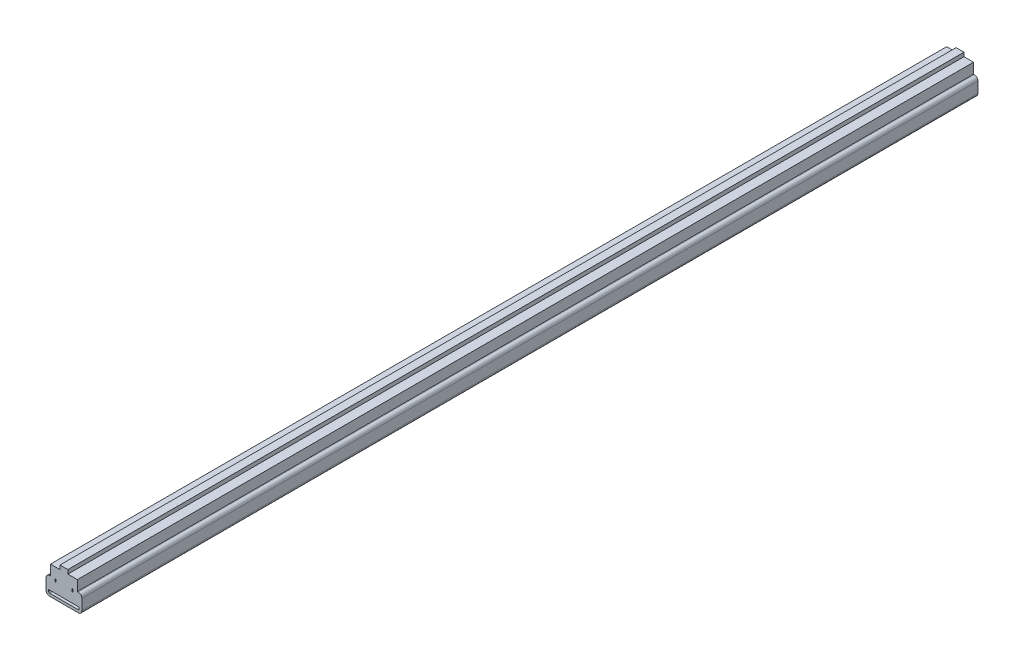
ISO-10303-21;
HEADER;
FILE_DESCRIPTION(('STEP AP214'),'2;1');
FILE_NAME('part.step','',(''),(''),'','','');
FILE_SCHEMA(('AUTOMOTIVE_DESIGN { 1 0 10303 214 1 1 1 1 }'));
ENDSEC;
DATA;
#1=APPLICATION_CONTEXT('core data for automotive mechanical design processes');
#2=APPLICATION_PROTOCOL_DEFINITION('international standard','automotive_design',2000,#1);
#3=PRODUCT_CONTEXT('',#1,'mechanical');
#4=PRODUCT('Part','Part','',(#3));
#5=PRODUCT_RELATED_PRODUCT_CATEGORY('part','',(#4));
#6=PRODUCT_DEFINITION_FORMATION('','',#4);
#7=PRODUCT_DEFINITION_CONTEXT('part definition',#1,'design');
#8=PRODUCT_DEFINITION('design','',#6,#7);
#9=PRODUCT_DEFINITION_SHAPE('','',#8);
#10=(LENGTH_UNIT() NAMED_UNIT(*) SI_UNIT(.MILLI.,.METRE.));
#11=(NAMED_UNIT(*) PLANE_ANGLE_UNIT() SI_UNIT($,.RADIAN.));
#12=(NAMED_UNIT(*) SI_UNIT($,.STERADIAN.) SOLID_ANGLE_UNIT());
#13=UNCERTAINTY_MEASURE_WITH_UNIT(LENGTH_MEASURE(1.E-05),#10,'distance_accuracy_value','');
#14=(GEOMETRIC_REPRESENTATION_CONTEXT(3) GLOBAL_UNCERTAINTY_ASSIGNED_CONTEXT((#13)) GLOBAL_UNIT_ASSIGNED_CONTEXT((#10,
#11,#12)) REPRESENTATION_CONTEXT('',''));
#15=CARTESIAN_POINT('',(0.,0.,0.));
#16=DIRECTION('',(0.,0.,1.));
#17=DIRECTION('',(1.,0.,0.));
#18=AXIS2_PLACEMENT_3D('',#15,#16,#17);
#19=CARTESIAN_POINT('',(-8.,8.,500.));
#20=DIRECTION('',(0.,0.,-1.));
#21=DIRECTION('',(-1.,0.,0.));
#22=AXIS2_PLACEMENT_3D('',#19,#20,#21);
#23=CYLINDRICAL_SURFACE('',#22,2.);
#24=CARTESIAN_POINT('',(-8.,8.,0.));
#25=DIRECTION('',(0.,0.,1.));
#26=DIRECTION('',(-1.,0.,0.));
#27=AXIS2_PLACEMENT_3D('',#24,#25,#26);
#28=CIRCLE('',#27,2.);
#29=CARTESIAN_POINT('',(-8.,10.,0.));
#30=VERTEX_POINT('',#29);
#31=CARTESIAN_POINT('',(-10.,8.,0.));
#32=VERTEX_POINT('',#31);
#33=EDGE_CURVE('E327',#30,#32,#28,.T.);
#34=ORIENTED_EDGE('',*,*,#33,.T.);
#35=DIRECTION('',(0.,0.,-1.));
#36=VECTOR('',#35,1.);
#37=CARTESIAN_POINT('',(-10.,8.,500.));
#38=LINE('',#37,#36);
#39=CARTESIAN_POINT('',(-10.,8.,500.));
#40=VERTEX_POINT('',#39);
#41=EDGE_CURVE('E9',#40,#32,#38,.T.);
#42=ORIENTED_EDGE('',*,*,#41,.F.);
#43=CARTESIAN_POINT('',(-8.,8.,500.));
#44=DIRECTION('',(0.,0.,1.));
#45=DIRECTION('',(-1.,0.,0.));
#46=AXIS2_PLACEMENT_3D('',#43,#44,#45);
#47=CIRCLE('',#46,2.);
#48=CARTESIAN_POINT('',(-8.,10.,500.));
#49=VERTEX_POINT('',#48);
#50=EDGE_CURVE('E328',#49,#40,#47,.T.);
#51=ORIENTED_EDGE('',*,*,#50,.F.);
#52=DIRECTION('',(0.,0.,-1.));
#53=VECTOR('',#52,1.);
#54=CARTESIAN_POINT('',(-8.,10.,500.));
#55=LINE('',#54,#53);
#56=EDGE_CURVE('E362',#49,#30,#55,.T.);
#57=ORIENTED_EDGE('',*,*,#56,.T.);
#58=EDGE_LOOP('',(#34,#42,#51,#57));
#59=FACE_BOUND('',#58,.T.);
#60=ADVANCED_FACE('F14',(#59),#23,.T.);
#61=CARTESIAN_POINT('',(-10.,8.,500.));
#62=DIRECTION('',(1.,0.,0.));
#63=DIRECTION('',(0.,0.,-1.));
#64=AXIS2_PLACEMENT_3D('',#61,#62,#63);
#65=PLANE('',#64);
#66=DIRECTION('',(0.,-1.,0.));
#67=VECTOR('',#66,1.);
#68=CARTESIAN_POINT('',(-10.,8.,0.));
#69=LINE('',#68,#67);
#70=CARTESIAN_POINT('',(-10.,2.,0.));
#71=VERTEX_POINT('',#70);
#72=EDGE_CURVE('E365',#32,#71,#69,.T.);
#73=ORIENTED_EDGE('',*,*,#72,.T.);
#74=DIRECTION('',(0.,0.,-1.));
#75=VECTOR('',#74,1.);
#76=CARTESIAN_POINT('',(-10.,2.,500.));
#77=LINE('',#76,#75);
#78=CARTESIAN_POINT('',(-10.,2.,500.));
#79=VERTEX_POINT('',#78);
#80=EDGE_CURVE('E21',#79,#71,#77,.T.);
#81=ORIENTED_EDGE('',*,*,#80,.F.);
#82=DIRECTION('',(0.,-1.,0.));
#83=VECTOR('',#82,1.);
#84=CARTESIAN_POINT('',(-10.,8.,500.));
#85=LINE('',#84,#83);
#86=EDGE_CURVE('E331',#40,#79,#85,.T.);
#87=ORIENTED_EDGE('',*,*,#86,.F.);
#88=ORIENTED_EDGE('',*,*,#41,.T.);
#89=EDGE_LOOP('',(#73,#81,#87,#88));
#90=FACE_BOUND('',#89,.T.);
#91=ADVANCED_FACE('F461',(#90),#65,.F.);
#92=CARTESIAN_POINT('',(-8.,2.,500.));
#93=DIRECTION('',(0.,0.,-1.));
#94=DIRECTION('',(-1.,0.,0.));
#95=AXIS2_PLACEMENT_3D('',#92,#93,#94);
#96=CYLINDRICAL_SURFACE('',#95,2.);
#97=CARTESIAN_POINT('',(-8.,2.,0.));
#98=DIRECTION('',(0.,0.,1.));
#99=DIRECTION('',(-1.,0.,0.));
#100=AXIS2_PLACEMENT_3D('',#97,#98,#99);
#101=CIRCLE('',#100,2.);
#102=CARTESIAN_POINT('',(-8.,0.,0.));
#103=VERTEX_POINT('',#102);
#104=EDGE_CURVE('E367',#71,#103,#101,.T.);
#105=ORIENTED_EDGE('',*,*,#104,.T.);
#106=DIRECTION('',(0.,0.,-1.));
#107=VECTOR('',#106,1.);
#108=CARTESIAN_POINT('',(-8.,0.,500.));
#109=LINE('',#108,#107);
#110=CARTESIAN_POINT('',(-8.,0.,500.));
#111=VERTEX_POINT('',#110);
#112=EDGE_CURVE('E432',#111,#103,#109,.T.);
#113=ORIENTED_EDGE('',*,*,#112,.F.);
#114=CARTESIAN_POINT('',(-8.,2.,500.));
#115=DIRECTION('',(0.,0.,1.));
#116=DIRECTION('',(-1.,0.,0.));
#117=AXIS2_PLACEMENT_3D('',#114,#115,#116);
#118=CIRCLE('',#117,2.);
#119=EDGE_CURVE('E334',#79,#111,#118,.T.);
#120=ORIENTED_EDGE('',*,*,#119,.F.);
#121=ORIENTED_EDGE('',*,*,#80,.T.);
#122=EDGE_LOOP('',(#105,#113,#120,#121));
#123=FACE_BOUND('',#122,.T.);
#124=ADVANCED_FACE('F439',(#123),#96,.T.);
#125=CARTESIAN_POINT('',(-8.,0.,500.));
#126=DIRECTION('',(0.,1.,0.));
#127=DIRECTION('',(0.,0.,1.));
#128=AXIS2_PLACEMENT_3D('',#125,#126,#127);
#129=PLANE('',#128);
#130=DIRECTION('',(1.,0.,0.));
#131=VECTOR('',#130,1.);
#132=CARTESIAN_POINT('',(-8.,0.,0.));
#133=LINE('',#132,#131);
#134=CARTESIAN_POINT('',(8.,0.,0.));
#135=VERTEX_POINT('',#134);
#136=EDGE_CURVE('E369',#103,#135,#133,.T.);
#137=ORIENTED_EDGE('',*,*,#136,.T.);
#138=DIRECTION('',(0.,0.,-1.));
#139=VECTOR('',#138,1.);
#140=CARTESIAN_POINT('',(8.,0.,500.));
#141=LINE('',#140,#139);
#142=CARTESIAN_POINT('',(8.,0.,500.));
#143=VERTEX_POINT('',#142);
#144=EDGE_CURVE('E429',#143,#135,#141,.T.);
#145=ORIENTED_EDGE('',*,*,#144,.F.);
#146=DIRECTION('',(1.,0.,0.));
#147=VECTOR('',#146,1.);
#148=CARTESIAN_POINT('',(-8.,0.,500.));
#149=LINE('',#148,#147);
#150=EDGE_CURVE('E336',#111,#143,#149,.T.);
#151=ORIENTED_EDGE('',*,*,#150,.F.);
#152=ORIENTED_EDGE('',*,*,#112,.T.);
#153=EDGE_LOOP('',(#137,#145,#151,#152));
#154=FACE_BOUND('',#153,.T.);
#155=ADVANCED_FACE('F449',(#154),#129,.F.);
#156=CARTESIAN_POINT('',(8.,2.,500.));
#157=DIRECTION('',(0.,0.,-1.));
#158=DIRECTION('',(-1.,0.,0.));
#159=AXIS2_PLACEMENT_3D('',#156,#157,#158);
#160=CYLINDRICAL_SURFACE('',#159,2.);
#161=CARTESIAN_POINT('',(8.,2.,0.));
#162=DIRECTION('',(0.,0.,1.));
#163=DIRECTION('',(-1.,0.,0.));
#164=AXIS2_PLACEMENT_3D('',#161,#162,#163);
#165=CIRCLE('',#164,2.);
#166=CARTESIAN_POINT('',(10.,2.,0.));
#167=VERTEX_POINT('',#166);
#168=EDGE_CURVE('E371',#135,#167,#165,.T.);
#169=ORIENTED_EDGE('',*,*,#168,.T.);
#170=DIRECTION('',(0.,0.,-1.));
#171=VECTOR('',#170,1.);
#172=CARTESIAN_POINT('',(10.,2.,500.));
#173=LINE('',#172,#171);
#174=CARTESIAN_POINT('',(10.,2.,500.));
#175=VERTEX_POINT('',#174);
#176=EDGE_CURVE('E426',#175,#167,#173,.T.);
#177=ORIENTED_EDGE('',*,*,#176,.F.);
#178=CARTESIAN_POINT('',(8.,2.,500.));
#179=DIRECTION('',(0.,0.,1.));
#180=DIRECTION('',(-1.,0.,0.));
#181=AXIS2_PLACEMENT_3D('',#178,#179,#180);
#182=CIRCLE('',#181,2.);
#183=EDGE_CURVE('E338',#143,#175,#182,.T.);
#184=ORIENTED_EDGE('',*,*,#183,.F.);
#185=ORIENTED_EDGE('',*,*,#144,.T.);
#186=EDGE_LOOP('',(#169,#177,#184,#185));
#187=FACE_BOUND('',#186,.T.);
#188=ADVANCED_FACE('F453',(#187),#160,.T.);
#189=CARTESIAN_POINT('',(10.,8.,500.));
#190=DIRECTION('',(-1.,0.,0.));
#191=DIRECTION('',(0.,0.,1.));
#192=AXIS2_PLACEMENT_3D('',#189,#190,#191);
#193=PLANE('',#192);
#194=DIRECTION('',(0.,1.,0.));
#195=VECTOR('',#194,1.);
#196=CARTESIAN_POINT('',(10.,8.,0.));
#197=LINE('',#196,#195);
#198=CARTESIAN_POINT('',(10.,8.,0.));
#199=VERTEX_POINT('',#198);
#200=EDGE_CURVE('E373',#167,#199,#197,.T.);
#201=ORIENTED_EDGE('',*,*,#200,.T.);
#202=DIRECTION('',(0.,0.,-1.));
#203=VECTOR('',#202,1.);
#204=CARTESIAN_POINT('',(10.,8.,500.));
#205=LINE('',#204,#203);
#206=CARTESIAN_POINT('',(10.,8.,500.));
#207=VERTEX_POINT('',#206);
#208=EDGE_CURVE('E423',#207,#199,#205,.T.);
#209=ORIENTED_EDGE('',*,*,#208,.F.);
#210=DIRECTION('',(0.,1.,0.));
#211=VECTOR('',#210,1.);
#212=CARTESIAN_POINT('',(10.,8.,500.));
#213=LINE('',#212,#211);
#214=EDGE_CURVE('E340',#175,#207,#213,.T.);
#215=ORIENTED_EDGE('',*,*,#214,.F.);
#216=ORIENTED_EDGE('',*,*,#176,.T.);
#217=EDGE_LOOP('',(#201,#209,#215,#216));
#218=FACE_BOUND('',#217,.T.);
#219=ADVANCED_FACE('F514',(#218),#193,.F.);
#220=CARTESIAN_POINT('',(8.,8.,500.));
#221=DIRECTION('',(0.,0.,-1.));
#222=DIRECTION('',(-1.,0.,0.));
#223=AXIS2_PLACEMENT_3D('',#220,#221,#222);
#224=CYLINDRICAL_SURFACE('',#223,2.);
#225=CARTESIAN_POINT('',(8.,8.,0.));
#226=DIRECTION('',(0.,0.,1.));
#227=DIRECTION('',(-1.,0.,0.));
#228=AXIS2_PLACEMENT_3D('',#225,#226,#227);
#229=CIRCLE('',#228,2.);
#230=CARTESIAN_POINT('',(8.,10.,0.));
#231=VERTEX_POINT('',#230);
#232=EDGE_CURVE('E375',#199,#231,#229,.T.);
#233=ORIENTED_EDGE('',*,*,#232,.T.);
#234=DIRECTION('',(0.,0.,-1.));
#235=VECTOR('',#234,1.);
#236=CARTESIAN_POINT('',(8.,10.,500.));
#237=LINE('',#236,#235);
#238=CARTESIAN_POINT('',(8.,10.,500.));
#239=VERTEX_POINT('',#238);
#240=EDGE_CURVE('E420',#239,#231,#237,.T.);
#241=ORIENTED_EDGE('',*,*,#240,.F.);
#242=CARTESIAN_POINT('',(8.,8.,500.));
#243=DIRECTION('',(0.,0.,1.));
#244=DIRECTION('',(-1.,0.,0.));
#245=AXIS2_PLACEMENT_3D('',#242,#243,#244);
#246=CIRCLE('',#245,2.);
#247=EDGE_CURVE('E342',#207,#239,#246,.T.);
#248=ORIENTED_EDGE('',*,*,#247,.F.);
#249=ORIENTED_EDGE('',*,*,#208,.T.);
#250=EDGE_LOOP('',(#233,#241,#248,#249));
#251=FACE_BOUND('',#250,.T.);
#252=ADVANCED_FACE('F511',(#251),#224,.T.);
#253=CARTESIAN_POINT('',(7.5,10.,500.));
#254=DIRECTION('',(0.,-1.,0.));
#255=DIRECTION('',(0.,0.,-1.));
#256=AXIS2_PLACEMENT_3D('',#253,#254,#255);
#257=PLANE('',#256);
#258=DIRECTION('',(-1.,0.,0.));
#259=VECTOR('',#258,1.);
#260=CARTESIAN_POINT('',(7.5,10.,0.));
#261=LINE('',#260,#259);
#262=CARTESIAN_POINT('',(7.5,10.,0.));
#263=VERTEX_POINT('',#262);
#264=EDGE_CURVE('E377',#231,#263,#261,.T.);
#265=ORIENTED_EDGE('',*,*,#264,.T.);
#266=DIRECTION('',(0.,0.,-1.));
#267=VECTOR('',#266,1.);
#268=CARTESIAN_POINT('',(7.5,10.,500.));
#269=LINE('',#268,#267);
#270=CARTESIAN_POINT('',(7.5,10.,500.));
#271=VERTEX_POINT('',#270);
#272=EDGE_CURVE('E417',#271,#263,#269,.T.);
#273=ORIENTED_EDGE('',*,*,#272,.F.);
#274=DIRECTION('',(-1.,0.,0.));
#275=VECTOR('',#274,1.);
#276=CARTESIAN_POINT('',(7.5,10.,500.));
#277=LINE('',#276,#275);
#278=EDGE_CURVE('E344',#239,#271,#277,.T.);
#279=ORIENTED_EDGE('',*,*,#278,.F.);
#280=ORIENTED_EDGE('',*,*,#240,.T.);
#281=EDGE_LOOP('',(#265,#273,#279,#280));
#282=FACE_BOUND('',#281,.T.);
#283=ADVANCED_FACE('F507',(#282),#257,.F.);
#284=CARTESIAN_POINT('',(7.5,15.8,500.));
#285=DIRECTION('',(-1.,0.,0.));
#286=DIRECTION('',(0.,0.,1.));
#287=AXIS2_PLACEMENT_3D('',#284,#285,#286);
#288=PLANE('',#287);
#289=DIRECTION('',(0.,1.,0.));
#290=VECTOR('',#289,1.);
#291=CARTESIAN_POINT('',(7.5,15.8,0.));
#292=LINE('',#291,#290);
#293=CARTESIAN_POINT('',(7.5,15.8,0.));
#294=VERTEX_POINT('',#293);
#295=EDGE_CURVE('E379',#263,#294,#292,.T.);
#296=ORIENTED_EDGE('',*,*,#295,.T.);
#297=DIRECTION('',(0.,0.,-1.));
#298=VECTOR('',#297,1.);
#299=CARTESIAN_POINT('',(7.5,15.8,500.));
#300=LINE('',#299,#298);
#301=CARTESIAN_POINT('',(7.5,15.8,500.));
#302=VERTEX_POINT('',#301);
#303=EDGE_CURVE('E414',#302,#294,#300,.T.);
#304=ORIENTED_EDGE('',*,*,#303,.F.);
#305=DIRECTION('',(0.,1.,0.));
#306=VECTOR('',#305,1.);
#307=CARTESIAN_POINT('',(7.5,15.8,500.));
#308=LINE('',#307,#306);
#309=EDGE_CURVE('E346',#271,#302,#308,.T.);
#310=ORIENTED_EDGE('',*,*,#309,.F.);
#311=ORIENTED_EDGE('',*,*,#272,.T.);
#312=EDGE_LOOP('',(#296,#304,#310,#311));
#313=FACE_BOUND('',#312,.T.);
#314=ADVANCED_FACE('F503',(#313),#288,.F.);
#315=CARTESIAN_POINT('',(2.2,15.8,500.));
#316=DIRECTION('',(0.,-1.,0.));
#317=DIRECTION('',(0.,0.,-1.));
#318=AXIS2_PLACEMENT_3D('',#315,#316,#317);
#319=PLANE('',#318);
#320=DIRECTION('',(-1.,0.,0.));
#321=VECTOR('',#320,1.);
#322=CARTESIAN_POINT('',(2.2,15.8,0.));
#323=LINE('',#322,#321);
#324=CARTESIAN_POINT('',(2.2,15.8,0.));
#325=VERTEX_POINT('',#324);
#326=EDGE_CURVE('E381',#294,#325,#323,.T.);
#327=ORIENTED_EDGE('',*,*,#326,.T.);
#328=DIRECTION('',(0.,0.,-1.));
#329=VECTOR('',#328,1.);
#330=CARTESIAN_POINT('',(2.2,15.8,500.));
#331=LINE('',#330,#329);
#332=CARTESIAN_POINT('',(2.2,15.8,500.));
#333=VERTEX_POINT('',#332);
#334=EDGE_CURVE('E411',#333,#325,#331,.T.);
#335=ORIENTED_EDGE('',*,*,#334,.F.);
#336=DIRECTION('',(-1.,0.,0.));
#337=VECTOR('',#336,1.);
#338=CARTESIAN_POINT('',(2.2,15.8,500.));
#339=LINE('',#338,#337);
#340=EDGE_CURVE('E348',#302,#333,#339,.T.);
#341=ORIENTED_EDGE('',*,*,#340,.F.);
#342=ORIENTED_EDGE('',*,*,#303,.T.);
#343=EDGE_LOOP('',(#327,#335,#341,#342));
#344=FACE_BOUND('',#343,.T.);
#345=ADVANCED_FACE('F498',(#344),#319,.F.);
#346=CARTESIAN_POINT('',(2.2,18.,500.));
#347=DIRECTION('',(-1.,0.,0.));
#348=DIRECTION('',(0.,-1.,0.));
#349=AXIS2_PLACEMENT_3D('',#346,#347,#348);
#350=PLANE('',#349);
#351=DIRECTION('',(0.,1.,0.));
#352=VECTOR('',#351,1.);
#353=CARTESIAN_POINT('',(2.2,18.,0.));
#354=LINE('',#353,#352);
#355=CARTESIAN_POINT('',(2.2,18.,0.));
#356=VERTEX_POINT('',#355);
#357=EDGE_CURVE('E383',#325,#356,#354,.T.);
#358=ORIENTED_EDGE('',*,*,#357,.T.);
#359=DIRECTION('',(0.,0.,-1.));
#360=VECTOR('',#359,1.);
#361=CARTESIAN_POINT('',(2.2,18.,500.));
#362=LINE('',#361,#360);
#363=CARTESIAN_POINT('',(2.2,18.,500.));
#364=VERTEX_POINT('',#363);
#365=EDGE_CURVE('E408',#364,#356,#362,.T.);
#366=ORIENTED_EDGE('',*,*,#365,.F.);
#367=DIRECTION('',(0.,1.,0.));
#368=VECTOR('',#367,1.);
#369=CARTESIAN_POINT('',(2.2,18.,500.));
#370=LINE('',#369,#368);
#371=EDGE_CURVE('E350',#333,#364,#370,.T.);
#372=ORIENTED_EDGE('',*,*,#371,.F.);
#373=ORIENTED_EDGE('',*,*,#334,.T.);
#374=EDGE_LOOP('',(#358,#366,#372,#373));
#375=FACE_BOUND('',#374,.T.);
#376=ADVANCED_FACE('F492',(#375),#350,.F.);
#377=CARTESIAN_POINT('',(-2.20000000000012,18.,500.));
#378=DIRECTION('',(0.,-1.,0.));
#379=DIRECTION('',(0.,0.,-1.));
#380=AXIS2_PLACEMENT_3D('',#377,#378,#379);
#381=PLANE('',#380);
#382=DIRECTION('',(-1.,0.,0.));
#383=VECTOR('',#382,1.);
#384=CARTESIAN_POINT('',(-2.20000000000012,18.,0.));
#385=LINE('',#384,#383);
#386=CARTESIAN_POINT('',(-2.20000000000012,18.,0.));
#387=VERTEX_POINT('',#386);
#388=EDGE_CURVE('E385',#356,#387,#385,.T.);
#389=ORIENTED_EDGE('',*,*,#388,.T.);
#390=DIRECTION('',(0.,0.,-1.));
#391=VECTOR('',#390,1.);
#392=CARTESIAN_POINT('',(-2.20000000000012,18.,500.));
#393=LINE('',#392,#391);
#394=CARTESIAN_POINT('',(-2.20000000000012,18.,500.));
#395=VERTEX_POINT('',#394);
#396=EDGE_CURVE('E405',#395,#387,#393,.T.);
#397=ORIENTED_EDGE('',*,*,#396,.F.);
#398=DIRECTION('',(-1.,0.,0.));
#399=VECTOR('',#398,1.);
#400=CARTESIAN_POINT('',(-2.20000000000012,18.,500.));
#401=LINE('',#400,#399);
#402=EDGE_CURVE('E352',#364,#395,#401,.T.);
#403=ORIENTED_EDGE('',*,*,#402,.F.);
#404=ORIENTED_EDGE('',*,*,#365,.T.);
#405=EDGE_LOOP('',(#389,#397,#403,#404));
#406=FACE_BOUND('',#405,.T.);
#407=ADVANCED_FACE('F488',(#406),#381,.F.);
#408=CARTESIAN_POINT('',(-2.20000000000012,18.,500.));
#409=DIRECTION('',(1.,0.,0.));
#410=DIRECTION('',(0.,1.,0.));
#411=AXIS2_PLACEMENT_3D('',#408,#409,#410);
#412=PLANE('',#411);
#413=DIRECTION('',(0.,-1.,0.));
#414=VECTOR('',#413,1.);
#415=CARTESIAN_POINT('',(-2.20000000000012,18.,0.));
#416=LINE('',#415,#414);
#417=CARTESIAN_POINT('',(-2.20000000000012,15.8,0.));
#418=VERTEX_POINT('',#417);
#419=EDGE_CURVE('E387',#387,#418,#416,.T.);
#420=ORIENTED_EDGE('',*,*,#419,.T.);
#421=DIRECTION('',(0.,0.,-1.));
#422=VECTOR('',#421,1.);
#423=CARTESIAN_POINT('',(-2.20000000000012,15.8,500.));
#424=LINE('',#423,#422);
#425=CARTESIAN_POINT('',(-2.20000000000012,15.8,500.));
#426=VERTEX_POINT('',#425);
#427=EDGE_CURVE('E402',#426,#418,#424,.T.);
#428=ORIENTED_EDGE('',*,*,#427,.F.);
#429=DIRECTION('',(0.,-1.,0.));
#430=VECTOR('',#429,1.);
#431=CARTESIAN_POINT('',(-2.20000000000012,18.,500.));
#432=LINE('',#431,#430);
#433=EDGE_CURVE('E354',#395,#426,#432,.T.);
#434=ORIENTED_EDGE('',*,*,#433,.F.);
#435=ORIENTED_EDGE('',*,*,#396,.T.);
#436=EDGE_LOOP('',(#420,#428,#434,#435));
#437=FACE_BOUND('',#436,.T.);
#438=ADVANCED_FACE('F483',(#437),#412,.F.);
#439=CARTESIAN_POINT('',(-2.20000000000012,15.8,500.));
#440=DIRECTION('',(0.,-1.,0.));
#441=DIRECTION('',(0.,0.,-1.));
#442=AXIS2_PLACEMENT_3D('',#439,#440,#441);
#443=PLANE('',#442);
#444=DIRECTION('',(-1.,0.,0.));
#445=VECTOR('',#444,1.);
#446=CARTESIAN_POINT('',(-2.20000000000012,15.8,0.));
#447=LINE('',#446,#445);
#448=CARTESIAN_POINT('',(-7.5,15.8,0.));
#449=VERTEX_POINT('',#448);
#450=EDGE_CURVE('E389',#418,#449,#447,.T.);
#451=ORIENTED_EDGE('',*,*,#450,.T.);
#452=DIRECTION('',(0.,0.,-1.));
#453=VECTOR('',#452,1.);
#454=CARTESIAN_POINT('',(-7.5,15.8,500.));
#455=LINE('',#454,#453);
#456=CARTESIAN_POINT('',(-7.5,15.8,500.));
#457=VERTEX_POINT('',#456);
#458=EDGE_CURVE('E399',#457,#449,#455,.T.);
#459=ORIENTED_EDGE('',*,*,#458,.F.);
#460=DIRECTION('',(-1.,0.,0.));
#461=VECTOR('',#460,1.);
#462=CARTESIAN_POINT('',(-2.20000000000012,15.8,500.));
#463=LINE('',#462,#461);
#464=EDGE_CURVE('E356',#426,#457,#463,.T.);
#465=ORIENTED_EDGE('',*,*,#464,.F.);
#466=ORIENTED_EDGE('',*,*,#427,.T.);
#467=EDGE_LOOP('',(#451,#459,#465,#466));
#468=FACE_BOUND('',#467,.T.);
#469=ADVANCED_FACE('F477',(#468),#443,.F.);
#470=CARTESIAN_POINT('',(-7.5,15.8,500.));
#471=DIRECTION('',(1.,0.,0.));
#472=DIRECTION('',(0.,1.,0.));
#473=AXIS2_PLACEMENT_3D('',#470,#471,#472);
#474=PLANE('',#473);
#475=DIRECTION('',(0.,-1.,0.));
#476=VECTOR('',#475,1.);
#477=CARTESIAN_POINT('',(-7.5,15.8,0.));
#478=LINE('',#477,#476);
#479=CARTESIAN_POINT('',(-7.5,10.,0.));
#480=VERTEX_POINT('',#479);
#481=EDGE_CURVE('E391',#449,#480,#478,.T.);
#482=ORIENTED_EDGE('',*,*,#481,.T.);
#483=DIRECTION('',(0.,0.,-1.));
#484=VECTOR('',#483,1.);
#485=CARTESIAN_POINT('',(-7.5,10.,500.));
#486=LINE('',#485,#484);
#487=CARTESIAN_POINT('',(-7.5,10.,500.));
#488=VERTEX_POINT('',#487);
#489=EDGE_CURVE('E396',#488,#480,#486,.T.);
#490=ORIENTED_EDGE('',*,*,#489,.F.);
#491=DIRECTION('',(0.,-1.,0.));
#492=VECTOR('',#491,1.);
#493=CARTESIAN_POINT('',(-7.5,15.8,500.));
#494=LINE('',#493,#492);
#495=EDGE_CURVE('E358',#457,#488,#494,.T.);
#496=ORIENTED_EDGE('',*,*,#495,.F.);
#497=ORIENTED_EDGE('',*,*,#458,.T.);
#498=EDGE_LOOP('',(#482,#490,#496,#497));
#499=FACE_BOUND('',#498,.T.);
#500=ADVANCED_FACE('F473',(#499),#474,.F.);
#501=CARTESIAN_POINT('',(-8.,10.,500.));
#502=DIRECTION('',(0.,-1.,0.));
#503=DIRECTION('',(0.,0.,-1.));
#504=AXIS2_PLACEMENT_3D('',#501,#502,#503);
#505=PLANE('',#504);
#506=DIRECTION('',(-1.,0.,0.));
#507=VECTOR('',#506,1.);
#508=CARTESIAN_POINT('',(-8.,10.,0.));
#509=LINE('',#508,#507);
#510=EDGE_CURVE('E332',#480,#30,#509,.T.);
#511=ORIENTED_EDGE('',*,*,#510,.T.);
#512=ORIENTED_EDGE('',*,*,#56,.F.);
#513=DIRECTION('',(-1.,0.,0.));
#514=VECTOR('',#513,1.);
#515=CARTESIAN_POINT('',(-8.,10.,500.));
#516=LINE('',#515,#514);
#517=EDGE_CURVE('E360',#488,#49,#516,.T.);
#518=ORIENTED_EDGE('',*,*,#517,.F.);
#519=ORIENTED_EDGE('',*,*,#489,.T.);
#520=EDGE_LOOP('',(#511,#512,#518,#519));
#521=FACE_BOUND('',#520,.T.);
#522=ADVANCED_FACE('F468',(#521),#505,.F.);
#523=CARTESIAN_POINT('',(-8.,8.,500.));
#524=DIRECTION('',(0.,0.,-1.));
#525=DIRECTION('',(-1.,0.,0.));
#526=AXIS2_PLACEMENT_3D('',#523,#524,#525);
#527=PLANE('',#526);
#528=DIRECTION('',(-1.,1.80411241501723E-13,0.));
#529=VECTOR('',#528,1.);
#530=CARTESIAN_POINT('',(4.45478069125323,9.99948873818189,500.));
#531=LINE('',#530,#529);
#532=CARTESIAN_POINT('',(4.95478069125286,9.9994887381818,500.));
#533=VERTEX_POINT('',#532);
#534=CARTESIAN_POINT('',(4.45478069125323,9.99948873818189,500.));
#535=VERTEX_POINT('',#534);
#536=EDGE_CURVE('E234',#533,#535,#531,.T.);
#537=ORIENTED_EDGE('',*,*,#536,.F.);
#538=DIRECTION('',(0.,1.,0.));
#539=VECTOR('',#538,1.);
#540=CARTESIAN_POINT('',(4.95478069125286,8.49948873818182,500.));
#541=LINE('',#540,#539);
#542=CARTESIAN_POINT('',(4.95478069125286,8.49948873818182,500.));
#543=VERTEX_POINT('',#542);
#544=EDGE_CURVE('E227',#543,#533,#541,.T.);
#545=ORIENTED_EDGE('',*,*,#544,.F.);
#546=DIRECTION('',(1.,-1.52655665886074E-13,0.));
#547=VECTOR('',#546,1.);
#548=CARTESIAN_POINT('',(4.45478069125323,8.49948873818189,500.));
#549=LINE('',#548,#547);
#550=CARTESIAN_POINT('',(4.45478069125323,8.49948873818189,500.));
#551=VERTEX_POINT('',#550);
#552=EDGE_CURVE('E238',#551,#543,#549,.T.);
#553=ORIENTED_EDGE('',*,*,#552,.F.);
#554=DIRECTION('',(0.,-1.,0.));
#555=VECTOR('',#554,1.);
#556=CARTESIAN_POINT('',(4.45478069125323,8.49948873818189,500.));
#557=LINE('',#556,#555);
#558=EDGE_CURVE('E28',#535,#551,#557,.T.);
#559=ORIENTED_EDGE('',*,*,#558,.F.);
#560=EDGE_LOOP('',(#537,#545,#553,#559));
#561=FACE_BOUND('',#560,.T.);
#562=DIRECTION('',(-1.,-1.45716771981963E-13,0.));
#563=VECTOR('',#562,1.);
#564=CARTESIAN_POINT('',(-5.04521930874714,9.99948873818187,500.));
#565=LINE('',#564,#563);
#566=CARTESIAN_POINT('',(-4.54521930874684,9.99948873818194,500.));
#567=VERTEX_POINT('',#566);
#568=CARTESIAN_POINT('',(-5.04521930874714,9.99948873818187,500.));
#569=VERTEX_POINT('',#568);
#570=EDGE_CURVE('E251',#567,#569,#565,.T.);
#571=ORIENTED_EDGE('',*,*,#570,.F.);
#572=DIRECTION('',(0.,1.,0.));
#573=VECTOR('',#572,1.);
#574=CARTESIAN_POINT('',(-4.54521930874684,8.49948873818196,500.));
#575=LINE('',#574,#573);
#576=CARTESIAN_POINT('',(-4.54521930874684,8.49948873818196,500.));
#577=VERTEX_POINT('',#576);
#578=EDGE_CURVE('E254',#577,#567,#575,.T.);
#579=ORIENTED_EDGE('',*,*,#578,.F.);
#580=DIRECTION('',(1.,1.52655665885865E-13,0.));
#581=VECTOR('',#580,1.);
#582=CARTESIAN_POINT('',(-5.04521930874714,8.49948873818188,500.));
#583=LINE('',#582,#581);
#584=CARTESIAN_POINT('',(-5.04521930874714,8.49948873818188,500.));
#585=VERTEX_POINT('',#584);
#586=EDGE_CURVE('E247',#585,#577,#583,.T.);
#587=ORIENTED_EDGE('',*,*,#586,.F.);
#588=DIRECTION('',(0.,-1.,0.));
#589=VECTOR('',#588,1.);
#590=CARTESIAN_POINT('',(-5.04521930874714,8.49948873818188,500.));
#591=LINE('',#590,#589);
#592=EDGE_CURVE('E248',#569,#585,#591,.T.);
#593=ORIENTED_EDGE('',*,*,#592,.F.);
#594=EDGE_LOOP('',(#571,#579,#587,#593));
#595=FACE_BOUND('',#594,.T.);
#596=CARTESIAN_POINT('',(7.95478069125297,1.99948873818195,500.));
#597=DIRECTION('',(0.,0.,1.));
#598=DIRECTION('',(1.,0.,0.));
#599=AXIS2_PLACEMENT_3D('',#596,#597,#598);
#600=CIRCLE('',#599,0.5);
#601=CARTESIAN_POINT('',(7.95478069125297,1.49948873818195,500.));
#602=VERTEX_POINT('',#601);
#603=CARTESIAN_POINT('',(8.45478069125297,1.99948873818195,500.));
#604=VERTEX_POINT('',#603);
#605=EDGE_CURVE('E289',#602,#604,#600,.T.);
#606=ORIENTED_EDGE('',*,*,#605,.F.);
#607=DIRECTION('',(1.,0.,0.));
#608=VECTOR('',#607,1.);
#609=CARTESIAN_POINT('',(-8.04521930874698,1.49948873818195,500.));
#610=LINE('',#609,#608);
#611=CARTESIAN_POINT('',(-8.04521930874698,1.49948873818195,500.));
#612=VERTEX_POINT('',#611);
#613=EDGE_CURVE('E292',#612,#602,#610,.T.);
#614=ORIENTED_EDGE('',*,*,#613,.F.);
#615=CARTESIAN_POINT('',(-8.04521930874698,1.99948873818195,500.));
#616=DIRECTION('',(0.,0.,1.));
#617=DIRECTION('',(1.,0.,0.));
#618=AXIS2_PLACEMENT_3D('',#615,#616,#617);
#619=CIRCLE('',#618,0.5);
#620=CARTESIAN_POINT('',(-8.54521930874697,1.99948873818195,500.));
#621=VERTEX_POINT('',#620);
#622=EDGE_CURVE('E279',#621,#612,#619,.T.);
#623=ORIENTED_EDGE('',*,*,#622,.F.);
#624=DIRECTION('',(0.,-1.,0.));
#625=VECTOR('',#624,1.);
#626=CARTESIAN_POINT('',(-8.54521930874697,2.99948873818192,500.));
#627=LINE('',#626,#625);
#628=CARTESIAN_POINT('',(-8.54521930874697,2.99948873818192,500.));
#629=VERTEX_POINT('',#628);
#630=EDGE_CURVE('E280',#629,#621,#627,.T.);
#631=ORIENTED_EDGE('',*,*,#630,.F.);
#632=DIRECTION('',(-1.,0.,0.));
#633=VECTOR('',#632,1.);
#634=CARTESIAN_POINT('',(-8.54521930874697,2.99948873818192,500.));
#635=LINE('',#634,#633);
#636=CARTESIAN_POINT('',(8.45478069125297,2.99948873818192,500.));
#637=VERTEX_POINT('',#636);
#638=EDGE_CURVE('E283',#637,#629,#635,.T.);
#639=ORIENTED_EDGE('',*,*,#638,.F.);
#640=DIRECTION('',(0.,1.,0.));
#641=VECTOR('',#640,1.);
#642=CARTESIAN_POINT('',(8.45478069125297,2.99948873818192,500.));
#643=LINE('',#642,#641);
#644=EDGE_CURVE('E286',#604,#637,#643,.T.);
#645=ORIENTED_EDGE('',*,*,#644,.F.);
#646=EDGE_LOOP('',(#606,#614,#623,#631,#639,#645));
#647=FACE_BOUND('',#646,.T.);
#648=ORIENTED_EDGE('',*,*,#50,.T.);
#649=ORIENTED_EDGE('',*,*,#86,.T.);
#650=ORIENTED_EDGE('',*,*,#119,.T.);
#651=ORIENTED_EDGE('',*,*,#150,.T.);
#652=ORIENTED_EDGE('',*,*,#183,.T.);
#653=ORIENTED_EDGE('',*,*,#214,.T.);
#654=ORIENTED_EDGE('',*,*,#247,.T.);
#655=ORIENTED_EDGE('',*,*,#278,.T.);
#656=ORIENTED_EDGE('',*,*,#309,.T.);
#657=ORIENTED_EDGE('',*,*,#340,.T.);
#658=ORIENTED_EDGE('',*,*,#371,.T.);
#659=ORIENTED_EDGE('',*,*,#402,.T.);
#660=ORIENTED_EDGE('',*,*,#433,.T.);
#661=ORIENTED_EDGE('',*,*,#464,.T.);
#662=ORIENTED_EDGE('',*,*,#495,.T.);
#663=ORIENTED_EDGE('',*,*,#517,.T.);
#664=EDGE_LOOP('',(#648,#649,#650,#651,#652,#653,#654,#655,#656,#657,#658,#659,#660,#661,#662,#663));
#665=FACE_BOUND('',#664,.T.);
#666=ADVANCED_FACE('F457',(#561,#595,#647,#665),#527,.F.);
#667=CARTESIAN_POINT('',(-8.,8.,0.));
#668=DIRECTION('',(0.,0.,-1.));
#669=DIRECTION('',(-1.,0.,0.));
#670=AXIS2_PLACEMENT_3D('',#667,#668,#669);
#671=PLANE('',#670);
#672=DIRECTION('',(0.,1.,0.));
#673=VECTOR('',#672,1.);
#674=CARTESIAN_POINT('',(4.95478069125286,8.49948873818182,0.));
#675=LINE('',#674,#673);
#676=CARTESIAN_POINT('',(4.95478069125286,8.49948873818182,0.));
#677=VERTEX_POINT('',#676);
#678=CARTESIAN_POINT('',(4.95478069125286,9.9994887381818,0.));
#679=VERTEX_POINT('',#678);
#680=EDGE_CURVE('E224',#677,#679,#675,.T.);
#681=ORIENTED_EDGE('',*,*,#680,.T.);
#682=DIRECTION('',(-1.,1.80411241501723E-13,0.));
#683=VECTOR('',#682,1.);
#684=CARTESIAN_POINT('',(4.45478069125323,9.99948873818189,0.));
#685=LINE('',#684,#683);
#686=CARTESIAN_POINT('',(4.45478069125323,9.99948873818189,0.));
#687=VERTEX_POINT('',#686);
#688=EDGE_CURVE('E211',#679,#687,#685,.T.);
#689=ORIENTED_EDGE('',*,*,#688,.T.);
#690=DIRECTION('',(0.,-1.,0.));
#691=VECTOR('',#690,1.);
#692=CARTESIAN_POINT('',(4.45478069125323,8.49948873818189,0.));
#693=LINE('',#692,#691);
#694=CARTESIAN_POINT('',(4.45478069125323,8.49948873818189,0.));
#695=VERTEX_POINT('',#694);
#696=EDGE_CURVE('E242',#687,#695,#693,.T.);
#697=ORIENTED_EDGE('',*,*,#696,.T.);
#698=DIRECTION('',(1.,-1.52655665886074E-13,0.));
#699=VECTOR('',#698,1.);
#700=CARTESIAN_POINT('',(4.45478069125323,8.49948873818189,0.));
#701=LINE('',#700,#699);
#702=EDGE_CURVE('E232',#695,#677,#701,.T.);
#703=ORIENTED_EDGE('',*,*,#702,.T.);
#704=EDGE_LOOP('',(#681,#689,#697,#703));
#705=FACE_BOUND('',#704,.T.);
#706=DIRECTION('',(0.,1.,0.));
#707=VECTOR('',#706,1.);
#708=CARTESIAN_POINT('',(-4.54521930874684,8.49948873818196,0.));
#709=LINE('',#708,#707);
#710=CARTESIAN_POINT('',(-4.54521930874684,8.49948873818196,0.));
#711=VERTEX_POINT('',#710);
#712=CARTESIAN_POINT('',(-4.54521930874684,9.99948873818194,0.));
#713=VERTEX_POINT('',#712);
#714=EDGE_CURVE('E250',#711,#713,#709,.T.);
#715=ORIENTED_EDGE('',*,*,#714,.T.);
#716=DIRECTION('',(-1.,-1.45716771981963E-13,0.));
#717=VECTOR('',#716,1.);
#718=CARTESIAN_POINT('',(-5.04521930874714,9.99948873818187,0.));
#719=LINE('',#718,#717);
#720=CARTESIAN_POINT('',(-5.04521930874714,9.99948873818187,0.));
#721=VERTEX_POINT('',#720);
#722=EDGE_CURVE('E271',#713,#721,#719,.T.);
#723=ORIENTED_EDGE('',*,*,#722,.T.);
#724=DIRECTION('',(0.,-1.,0.));
#725=VECTOR('',#724,1.);
#726=CARTESIAN_POINT('',(-5.04521930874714,8.49948873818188,0.));
#727=LINE('',#726,#725);
#728=CARTESIAN_POINT('',(-5.04521930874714,8.49948873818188,0.));
#729=VERTEX_POINT('',#728);
#730=EDGE_CURVE('E267',#721,#729,#727,.T.);
#731=ORIENTED_EDGE('',*,*,#730,.T.);
#732=DIRECTION('',(1.,1.52655665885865E-13,0.));
#733=VECTOR('',#732,1.);
#734=CARTESIAN_POINT('',(-5.04521930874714,8.49948873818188,0.));
#735=LINE('',#734,#733);
#736=EDGE_CURVE('E262',#729,#711,#735,.T.);
#737=ORIENTED_EDGE('',*,*,#736,.T.);
#738=EDGE_LOOP('',(#715,#723,#731,#737));
#739=FACE_BOUND('',#738,.T.);
#740=DIRECTION('',(1.,0.,0.));
#741=VECTOR('',#740,1.);
#742=CARTESIAN_POINT('',(-8.04521930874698,1.49948873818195,0.));
#743=LINE('',#742,#741);
#744=CARTESIAN_POINT('',(-8.04521930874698,1.49948873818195,0.));
#745=VERTEX_POINT('',#744);
#746=CARTESIAN_POINT('',(7.95478069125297,1.49948873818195,0.));
#747=VERTEX_POINT('',#746);
#748=EDGE_CURVE('E282',#745,#747,#743,.T.);
#749=ORIENTED_EDGE('',*,*,#748,.T.);
#750=CARTESIAN_POINT('',(7.95478069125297,1.99948873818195,0.));
#751=DIRECTION('',(0.,0.,-1.));
#752=DIRECTION('',(-1.,0.,0.));
#753=AXIS2_PLACEMENT_3D('',#750,#751,#752);
#754=CIRCLE('',#753,0.5);
#755=CARTESIAN_POINT('',(8.45478069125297,1.99948873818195,0.));
#756=VERTEX_POINT('',#755);
#757=EDGE_CURVE('E317',#747,#756,#754,.F.);
#758=ORIENTED_EDGE('',*,*,#757,.T.);
#759=DIRECTION('',(0.,1.,0.));
#760=VECTOR('',#759,1.);
#761=CARTESIAN_POINT('',(8.45478069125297,2.99948873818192,0.));
#762=LINE('',#761,#760);
#763=CARTESIAN_POINT('',(8.45478069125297,2.99948873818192,0.));
#764=VERTEX_POINT('',#763);
#765=EDGE_CURVE('E313',#756,#764,#762,.T.);
#766=ORIENTED_EDGE('',*,*,#765,.T.);
#767=DIRECTION('',(-1.,0.,0.));
#768=VECTOR('',#767,1.);
#769=CARTESIAN_POINT('',(-8.54521930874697,2.99948873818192,0.));
#770=LINE('',#769,#768);
#771=CARTESIAN_POINT('',(-8.54521930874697,2.99948873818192,0.));
#772=VERTEX_POINT('',#771);
#773=EDGE_CURVE('E309',#764,#772,#770,.T.);
#774=ORIENTED_EDGE('',*,*,#773,.T.);
#775=DIRECTION('',(0.,-1.,0.));
#776=VECTOR('',#775,1.);
#777=CARTESIAN_POINT('',(-8.54521930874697,2.99948873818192,0.));
#778=LINE('',#777,#776);
#779=CARTESIAN_POINT('',(-8.54521930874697,1.99948873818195,0.));
#780=VERTEX_POINT('',#779);
#781=EDGE_CURVE('E305',#772,#780,#778,.T.);
#782=ORIENTED_EDGE('',*,*,#781,.T.);
#783=CARTESIAN_POINT('',(-8.04521930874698,1.99948873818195,0.));
#784=DIRECTION('',(0.,0.,-1.));
#785=DIRECTION('',(-1.,0.,0.));
#786=AXIS2_PLACEMENT_3D('',#783,#784,#785);
#787=CIRCLE('',#786,0.5);
#788=EDGE_CURVE('E300',#780,#745,#787,.F.);
#789=ORIENTED_EDGE('',*,*,#788,.T.);
#790=EDGE_LOOP('',(#749,#758,#766,#774,#782,#789));
#791=FACE_BOUND('',#790,.T.);
#792=ORIENTED_EDGE('',*,*,#33,.F.);
#793=ORIENTED_EDGE('',*,*,#510,.F.);
#794=ORIENTED_EDGE('',*,*,#481,.F.);
#795=ORIENTED_EDGE('',*,*,#450,.F.);
#796=ORIENTED_EDGE('',*,*,#419,.F.);
#797=ORIENTED_EDGE('',*,*,#388,.F.);
#798=ORIENTED_EDGE('',*,*,#357,.F.);
#799=ORIENTED_EDGE('',*,*,#326,.F.);
#800=ORIENTED_EDGE('',*,*,#295,.F.);
#801=ORIENTED_EDGE('',*,*,#264,.F.);
#802=ORIENTED_EDGE('',*,*,#232,.F.);
#803=ORIENTED_EDGE('',*,*,#200,.F.);
#804=ORIENTED_EDGE('',*,*,#168,.F.);
#805=ORIENTED_EDGE('',*,*,#136,.F.);
#806=ORIENTED_EDGE('',*,*,#104,.F.);
#807=ORIENTED_EDGE('',*,*,#72,.F.);
#808=EDGE_LOOP('',(#792,#793,#794,#795,#796,#797,#798,#799,#800,#801,#802,#803,#804,#805,#806,#807));
#809=FACE_BOUND('',#808,.T.);
#810=ADVANCED_FACE('F230',(#705,#739,#791,#809),#671,.T.);
#811=CARTESIAN_POINT('',(-8.04521930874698,1.49948873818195,-17.066048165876));
#812=DIRECTION('',(0.,-1.,0.));
#813=DIRECTION('',(0.,0.,-1.));
#814=AXIS2_PLACEMENT_3D('',#811,#812,#813);
#815=PLANE('',#814);
#816=DIRECTION('',(0.,0.,1.));
#817=VECTOR('',#816,1.);
#818=CARTESIAN_POINT('',(-8.04521930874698,1.49948873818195,-17.066048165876));
#819=LINE('',#818,#817);
#820=EDGE_CURVE('E303',#745,#612,#819,.T.);
#821=ORIENTED_EDGE('',*,*,#820,.T.);
#822=ORIENTED_EDGE('',*,*,#613,.T.);
#823=DIRECTION('',(0.,0.,1.));
#824=VECTOR('',#823,1.);
#825=CARTESIAN_POINT('',(7.95478069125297,1.49948873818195,-17.066048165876));
#826=LINE('',#825,#824);
#827=EDGE_CURVE('E299',#747,#602,#826,.T.);
#828=ORIENTED_EDGE('',*,*,#827,.F.);
#829=ORIENTED_EDGE('',*,*,#748,.F.);
#830=EDGE_LOOP('',(#821,#822,#828,#829));
#831=FACE_BOUND('',#830,.T.);
#832=ADVANCED_FACE('F653',(#831),#815,.F.);
#833=CARTESIAN_POINT('',(7.95478069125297,1.99948873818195,-17.066048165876));
#834=DIRECTION('',(0.,0.,1.));
#835=DIRECTION('',(1.,0.,0.));
#836=AXIS2_PLACEMENT_3D('',#833,#834,#835);
#837=CYLINDRICAL_SURFACE('',#836,0.5);
#838=ORIENTED_EDGE('',*,*,#827,.T.);
#839=ORIENTED_EDGE('',*,*,#605,.T.);
#840=DIRECTION('',(0.,0.,1.));
#841=VECTOR('',#840,1.);
#842=CARTESIAN_POINT('',(8.45478069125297,1.99948873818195,-17.066048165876));
#843=LINE('',#842,#841);
#844=EDGE_CURVE('E316',#756,#604,#843,.T.);
#845=ORIENTED_EDGE('',*,*,#844,.F.);
#846=ORIENTED_EDGE('',*,*,#757,.F.);
#847=EDGE_LOOP('',(#838,#839,#845,#846));
#848=FACE_BOUND('',#847,.T.);
#849=ADVANCED_FACE('F661',(#848),#837,.F.);
#850=CARTESIAN_POINT('',(8.45478069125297,2.99948873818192,-17.066048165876));
#851=DIRECTION('',(1.,0.,0.));
#852=DIRECTION('',(0.,1.,0.));
#853=AXIS2_PLACEMENT_3D('',#850,#851,#852);
#854=PLANE('',#853);
#855=ORIENTED_EDGE('',*,*,#844,.T.);
#856=ORIENTED_EDGE('',*,*,#644,.T.);
#857=DIRECTION('',(0.,0.,1.));
#858=VECTOR('',#857,1.);
#859=CARTESIAN_POINT('',(8.45478069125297,2.99948873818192,-17.066048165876));
#860=LINE('',#859,#858);
#861=EDGE_CURVE('E312',#764,#637,#860,.T.);
#862=ORIENTED_EDGE('',*,*,#861,.F.);
#863=ORIENTED_EDGE('',*,*,#765,.F.);
#864=EDGE_LOOP('',(#855,#856,#862,#863));
#865=FACE_BOUND('',#864,.T.);
#866=ADVANCED_FACE('F670',(#865),#854,.F.);
#867=CARTESIAN_POINT('',(-8.54521930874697,2.99948873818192,-17.066048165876));
#868=DIRECTION('',(0.,1.,0.));
#869=DIRECTION('',(0.,0.,1.));
#870=AXIS2_PLACEMENT_3D('',#867,#868,#869);
#871=PLANE('',#870);
#872=ORIENTED_EDGE('',*,*,#861,.T.);
#873=ORIENTED_EDGE('',*,*,#638,.T.);
#874=DIRECTION('',(0.,0.,1.));
#875=VECTOR('',#874,1.);
#876=CARTESIAN_POINT('',(-8.54521930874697,2.99948873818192,-17.066048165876));
#877=LINE('',#876,#875);
#878=EDGE_CURVE('E308',#772,#629,#877,.T.);
#879=ORIENTED_EDGE('',*,*,#878,.F.);
#880=ORIENTED_EDGE('',*,*,#773,.F.);
#881=EDGE_LOOP('',(#872,#873,#879,#880));
#882=FACE_BOUND('',#881,.T.);
#883=ADVANCED_FACE('F679',(#882),#871,.F.);
#884=CARTESIAN_POINT('',(-8.54521930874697,2.99948873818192,-17.066048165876));
#885=DIRECTION('',(-1.,0.,0.));
#886=DIRECTION('',(0.,0.,1.));
#887=AXIS2_PLACEMENT_3D('',#884,#885,#886);
#888=PLANE('',#887);
#889=ORIENTED_EDGE('',*,*,#878,.T.);
#890=ORIENTED_EDGE('',*,*,#630,.T.);
#891=DIRECTION('',(0.,0.,1.));
#892=VECTOR('',#891,1.);
#893=CARTESIAN_POINT('',(-8.54521930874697,1.99948873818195,-17.066048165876));
#894=LINE('',#893,#892);
#895=EDGE_CURVE('E304',#780,#621,#894,.T.);
#896=ORIENTED_EDGE('',*,*,#895,.F.);
#897=ORIENTED_EDGE('',*,*,#781,.F.);
#898=EDGE_LOOP('',(#889,#890,#896,#897));
#899=FACE_BOUND('',#898,.T.);
#900=ADVANCED_FACE('F688',(#899),#888,.F.);
#901=CARTESIAN_POINT('',(-8.04521930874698,1.99948873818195,-17.066048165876));
#902=DIRECTION('',(0.,0.,1.));
#903=DIRECTION('',(1.,0.,0.));
#904=AXIS2_PLACEMENT_3D('',#901,#902,#903);
#905=CYLINDRICAL_SURFACE('',#904,0.5);
#906=ORIENTED_EDGE('',*,*,#895,.T.);
#907=ORIENTED_EDGE('',*,*,#622,.T.);
#908=ORIENTED_EDGE('',*,*,#820,.F.);
#909=ORIENTED_EDGE('',*,*,#788,.F.);
#910=EDGE_LOOP('',(#906,#907,#908,#909));
#911=FACE_BOUND('',#910,.T.);
#912=ADVANCED_FACE('F697',(#911),#905,.F.);
#913=CARTESIAN_POINT('',(-4.54521930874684,8.49948873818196,-17.066048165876));
#914=DIRECTION('',(1.,0.,0.));
#915=DIRECTION('',(0.,0.,-1.));
#916=AXIS2_PLACEMENT_3D('',#913,#914,#915);
#917=PLANE('',#916);
#918=DIRECTION('',(0.,0.,1.));
#919=VECTOR('',#918,1.);
#920=CARTESIAN_POINT('',(-4.54521930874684,8.49948873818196,-17.066048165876));
#921=LINE('',#920,#919);
#922=EDGE_CURVE('E265',#711,#577,#921,.T.);
#923=ORIENTED_EDGE('',*,*,#922,.T.);
#924=ORIENTED_EDGE('',*,*,#578,.T.);
#925=DIRECTION('',(0.,0.,1.));
#926=VECTOR('',#925,1.);
#927=CARTESIAN_POINT('',(-4.54521930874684,9.99948873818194,-17.066048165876));
#928=LINE('',#927,#926);
#929=EDGE_CURVE('E261',#713,#567,#928,.T.);
#930=ORIENTED_EDGE('',*,*,#929,.F.);
#931=ORIENTED_EDGE('',*,*,#714,.F.);
#932=EDGE_LOOP('',(#923,#924,#930,#931));
#933=FACE_BOUND('',#932,.T.);
#934=ADVANCED_FACE('F706',(#933),#917,.F.);
#935=CARTESIAN_POINT('',(-5.04521930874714,9.99948873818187,-17.066048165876));
#936=DIRECTION('',(-1.45716771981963E-13,1.,0.));
#937=DIRECTION('',(-1.,-1.45716771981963E-13,0.));
#938=AXIS2_PLACEMENT_3D('',#935,#936,#937);
#939=PLANE('',#938);
#940=ORIENTED_EDGE('',*,*,#929,.T.);
#941=ORIENTED_EDGE('',*,*,#570,.T.);
#942=DIRECTION('',(0.,0.,1.));
#943=VECTOR('',#942,1.);
#944=CARTESIAN_POINT('',(-5.04521930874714,9.99948873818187,-17.066048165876));
#945=LINE('',#944,#943);
#946=EDGE_CURVE('E270',#721,#569,#945,.T.);
#947=ORIENTED_EDGE('',*,*,#946,.F.);
#948=ORIENTED_EDGE('',*,*,#722,.F.);
#949=EDGE_LOOP('',(#940,#941,#947,#948));
#950=FACE_BOUND('',#949,.T.);
#951=ADVANCED_FACE('F715',(#950),#939,.F.);
#952=CARTESIAN_POINT('',(-5.04521930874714,8.49948873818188,-17.066048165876));
#953=DIRECTION('',(-1.,0.,0.));
#954=DIRECTION('',(0.,0.,1.));
#955=AXIS2_PLACEMENT_3D('',#952,#953,#954);
#956=PLANE('',#955);
#957=ORIENTED_EDGE('',*,*,#946,.T.);
#958=ORIENTED_EDGE('',*,*,#592,.T.);
#959=DIRECTION('',(0.,0.,1.));
#960=VECTOR('',#959,1.);
#961=CARTESIAN_POINT('',(-5.04521930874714,8.49948873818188,-17.066048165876));
#962=LINE('',#961,#960);
#963=EDGE_CURVE('E266',#729,#585,#962,.T.);
#964=ORIENTED_EDGE('',*,*,#963,.F.);
#965=ORIENTED_EDGE('',*,*,#730,.F.);
#966=EDGE_LOOP('',(#957,#958,#964,#965));
#967=FACE_BOUND('',#966,.T.);
#968=ADVANCED_FACE('F724',(#967),#956,.F.);
#969=CARTESIAN_POINT('',(-5.04521930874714,8.49948873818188,-17.066048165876));
#970=DIRECTION('',(1.52655665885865E-13,-1.,0.));
#971=DIRECTION('',(1.,1.52655665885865E-13,0.));
#972=AXIS2_PLACEMENT_3D('',#969,#970,#971);
#973=PLANE('',#972);
#974=ORIENTED_EDGE('',*,*,#963,.T.);
#975=ORIENTED_EDGE('',*,*,#586,.T.);
#976=ORIENTED_EDGE('',*,*,#922,.F.);
#977=ORIENTED_EDGE('',*,*,#736,.F.);
#978=EDGE_LOOP('',(#974,#975,#976,#977));
#979=FACE_BOUND('',#978,.T.);
#980=ADVANCED_FACE('F733',(#979),#973,.F.);
#981=CARTESIAN_POINT('',(4.95478069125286,8.49948873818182,-17.066048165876));
#982=DIRECTION('',(1.,0.,0.));
#983=DIRECTION('',(0.,0.,-1.));
#984=AXIS2_PLACEMENT_3D('',#981,#982,#983);
#985=PLANE('',#984);
#986=DIRECTION('',(0.,0.,1.));
#987=VECTOR('',#986,1.);
#988=CARTESIAN_POINT('',(4.95478069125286,8.49948873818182,-17.066048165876));
#989=LINE('',#988,#987);
#990=EDGE_CURVE('E36',#677,#543,#989,.T.);
#991=ORIENTED_EDGE('',*,*,#990,.T.);
#992=ORIENTED_EDGE('',*,*,#544,.T.);
#993=DIRECTION('',(0.,0.,1.));
#994=VECTOR('',#993,1.);
#995=CARTESIAN_POINT('',(4.95478069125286,9.9994887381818,-17.066048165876));
#996=LINE('',#995,#994);
#997=EDGE_CURVE('E215',#679,#533,#996,.T.);
#998=ORIENTED_EDGE('',*,*,#997,.F.);
#999=ORIENTED_EDGE('',*,*,#680,.F.);
#1000=EDGE_LOOP('',(#991,#992,#998,#999));
#1001=FACE_BOUND('',#1000,.T.);
#1002=ADVANCED_FACE('F223',(#1001),#985,.F.);
#1003=CARTESIAN_POINT('',(4.45478069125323,9.99948873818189,-17.066048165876));
#1004=DIRECTION('',(1.80411241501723E-13,1.,0.));
#1005=DIRECTION('',(-1.,1.80411241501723E-13,0.));
#1006=AXIS2_PLACEMENT_3D('',#1003,#1004,#1005);
#1007=PLANE('',#1006);
#1008=ORIENTED_EDGE('',*,*,#997,.T.);
#1009=ORIENTED_EDGE('',*,*,#536,.T.);
#1010=DIRECTION('',(0.,0.,1.));
#1011=VECTOR('',#1010,1.);
#1012=CARTESIAN_POINT('',(4.45478069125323,9.99948873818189,-17.066048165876));
#1013=LINE('',#1012,#1011);
#1014=EDGE_CURVE('E217',#687,#535,#1013,.T.);
#1015=ORIENTED_EDGE('',*,*,#1014,.F.);
#1016=ORIENTED_EDGE('',*,*,#688,.F.);
#1017=EDGE_LOOP('',(#1008,#1009,#1015,#1016));
#1018=FACE_BOUND('',#1017,.T.);
#1019=ADVANCED_FACE('F213',(#1018),#1007,.F.);
#1020=CARTESIAN_POINT('',(4.45478069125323,8.49948873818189,-17.066048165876));
#1021=DIRECTION('',(-1.,0.,0.));
#1022=DIRECTION('',(0.,0.,1.));
#1023=AXIS2_PLACEMENT_3D('',#1020,#1021,#1022);
#1024=PLANE('',#1023);
#1025=ORIENTED_EDGE('',*,*,#1014,.T.);
#1026=ORIENTED_EDGE('',*,*,#558,.T.);
#1027=DIRECTION('',(0.,0.,1.));
#1028=VECTOR('',#1027,1.);
#1029=CARTESIAN_POINT('',(4.45478069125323,8.49948873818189,-17.066048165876));
#1030=LINE('',#1029,#1028);
#1031=EDGE_CURVE('E241',#695,#551,#1030,.T.);
#1032=ORIENTED_EDGE('',*,*,#1031,.F.);
#1033=ORIENTED_EDGE('',*,*,#696,.F.);
#1034=EDGE_LOOP('',(#1025,#1026,#1032,#1033));
#1035=FACE_BOUND('',#1034,.T.);
#1036=ADVANCED_FACE('F757',(#1035),#1024,.F.);
#1037=CARTESIAN_POINT('',(4.45478069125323,8.49948873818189,-17.066048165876));
#1038=DIRECTION('',(-1.52655665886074E-13,-1.,0.));
#1039=DIRECTION('',(1.,-1.52655665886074E-13,0.));
#1040=AXIS2_PLACEMENT_3D('',#1037,#1038,#1039);
#1041=PLANE('',#1040);
#1042=ORIENTED_EDGE('',*,*,#1031,.T.);
#1043=ORIENTED_EDGE('',*,*,#552,.T.);
#1044=ORIENTED_EDGE('',*,*,#990,.F.);
#1045=ORIENTED_EDGE('',*,*,#702,.F.);
#1046=EDGE_LOOP('',(#1042,#1043,#1044,#1045));
#1047=FACE_BOUND('',#1046,.T.);
#1048=ADVANCED_FACE('F765',(#1047),#1041,.F.);
#1049=CLOSED_SHELL('',(#60,#91,#124,#155,#188,#219,#252,#283,#314,#345,#376,#407,#438,#469,#500,
#522,#666,#810,#832,#849,#866,#883,#900,#912,#934,#951,#968,#980,#1002,#1019,#1036,#1048));
#1050=MANIFOLD_SOLID_BREP('B1',#1049);
#1051=ADVANCED_BREP_SHAPE_REPRESENTATION('',(#18,#1050),#14);
#1052=SHAPE_DEFINITION_REPRESENTATION(#9,#1051);
ENDSEC;
END-ISO-10303-21;
